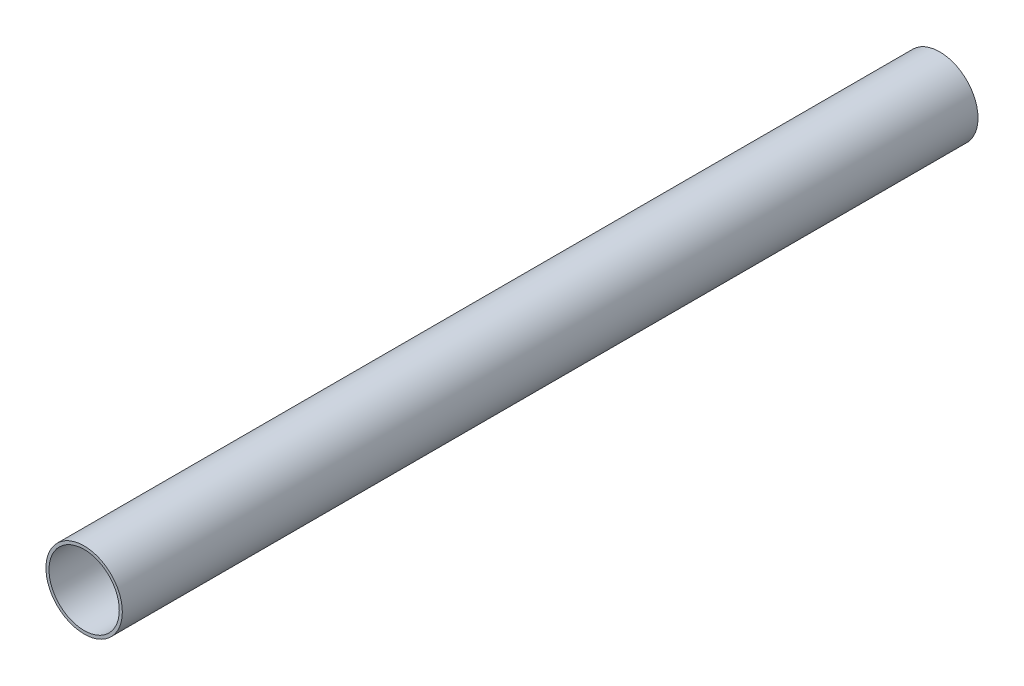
from build123d import *

# Parameters (mm, degrees)
ESQUISSE1_R      = 12.5
ESQUISSE1_R_2    = 11.5
EXTRUSION1_DEPTH = 280


with BuildPart() as part:
    # Esquisse1 → Extrusion1 (new body)
    with BuildSketch(Plane.XY):
        Circle(ESQUISSE1_R)
        Circle(ESQUISSE1_R_2, mode=Mode.SUBTRACT)
    extrude(amount=EXTRUSION1_DEPTH)


solid = part.part
